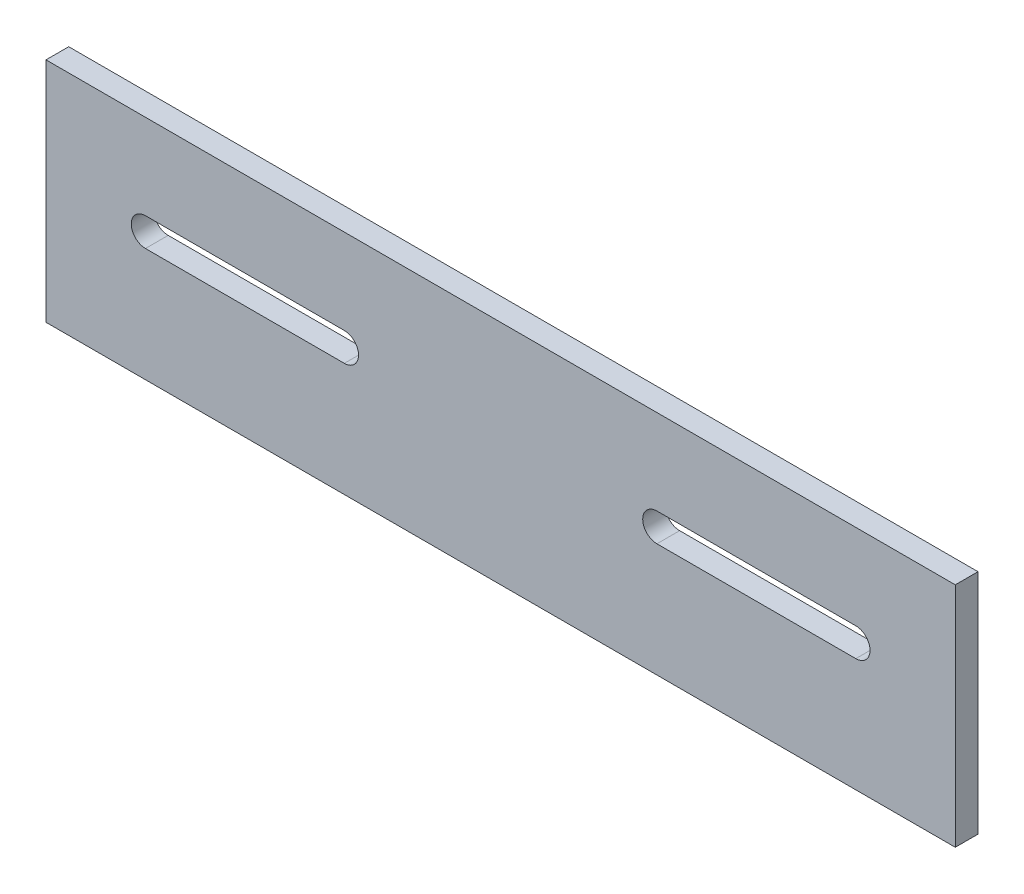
from build123d import *

# Parameters (mm, degrees)
SKETCH_1_W          = 320
SKETCH_1_H          = 80
EXTRUDE_1_DEPTH     = 8
CUT_EXTRUDE_1_DEPTH = 8


with BuildPart() as part:
    # Sketch 1 → Extrude 1 (new body)
    with BuildSketch(Plane.XY):
        Rectangle(SKETCH_1_W, SKETCH_1_H)
    extrude(amount=EXTRUDE_1_DEPTH)

    # Sketch 2 → Cut-Extrude 1 (cut)
    with BuildSketch(Plane.XY.offset(8)):
        with BuildLine():
            Line((-125, 10), (-55, 10))
            ThreePointArc((-55, 10), (-50, 5), (-55, 0))
            Line((-55, 0), (-125, 0))
            ThreePointArc((-125, 0), (-130, 5), (-125, 10))
        make_face()
        with BuildLine():
            Line((55, 10), (125, 10))
            ThreePointArc((125, 10), (130, 5), (125, 0))
            Line((125, 0), (55, 0))
            ThreePointArc((55, 0), (50, 5), (55, 10))
        make_face()
    extrude(amount=-CUT_EXTRUDE_1_DEPTH, mode=Mode.SUBTRACT)


solid = part.part
